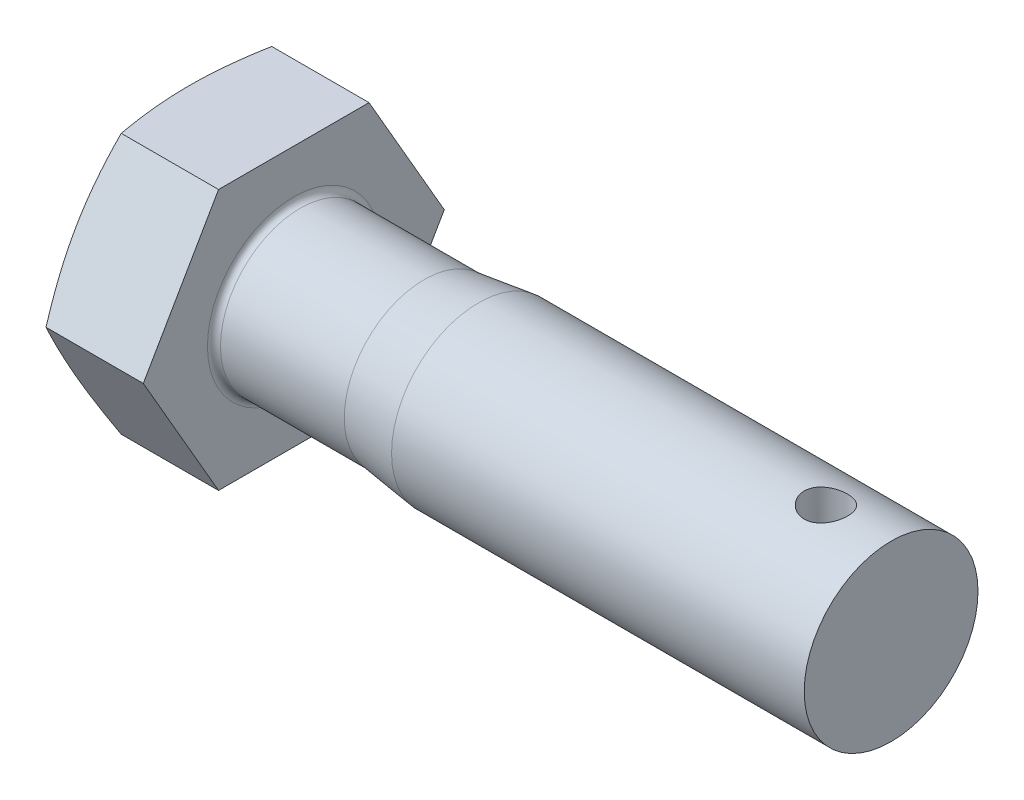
ISO-10303-21;
HEADER;
FILE_DESCRIPTION(('STEP AP214'),'2;1');
FILE_NAME('part.step','',(''),(''),'','','');
FILE_SCHEMA(('AUTOMOTIVE_DESIGN { 1 0 10303 214 1 1 1 1 }'));
ENDSEC;
DATA;
#1=APPLICATION_CONTEXT('core data for automotive mechanical design processes');
#2=APPLICATION_PROTOCOL_DEFINITION('international standard','automotive_design',2000,#1);
#3=PRODUCT_CONTEXT('',#1,'mechanical');
#4=PRODUCT('Part','Part','',(#3));
#5=PRODUCT_RELATED_PRODUCT_CATEGORY('part','',(#4));
#6=PRODUCT_DEFINITION_FORMATION('','',#4);
#7=PRODUCT_DEFINITION_CONTEXT('part definition',#1,'design');
#8=PRODUCT_DEFINITION('design','',#6,#7);
#9=PRODUCT_DEFINITION_SHAPE('','',#8);
#10=(LENGTH_UNIT() NAMED_UNIT(*) SI_UNIT(.MILLI.,.METRE.));
#11=(NAMED_UNIT(*) PLANE_ANGLE_UNIT() SI_UNIT($,.RADIAN.));
#12=(NAMED_UNIT(*) SI_UNIT($,.STERADIAN.) SOLID_ANGLE_UNIT());
#13=UNCERTAINTY_MEASURE_WITH_UNIT(LENGTH_MEASURE(1.E-05),#10,'distance_accuracy_value','');
#14=(GEOMETRIC_REPRESENTATION_CONTEXT(3) GLOBAL_UNCERTAINTY_ASSIGNED_CONTEXT((#13)) GLOBAL_UNIT_ASSIGNED_CONTEXT((#10,
#11,#12)) REPRESENTATION_CONTEXT('',''));
#15=CARTESIAN_POINT('',(0.,0.,0.));
#16=DIRECTION('',(0.,0.,1.));
#17=DIRECTION('',(1.,0.,0.));
#18=AXIS2_PLACEMENT_3D('',#15,#16,#17);
#19=CARTESIAN_POINT('',(0.,-12.,20.7846096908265));
#20=DIRECTION('',(-1.,0.,0.));
#21=DIRECTION('',(0.,0.,1.));
#22=AXIS2_PLACEMENT_3D('',#19,#20,#21);
#23=PLANE('',#22);
#24=CARTESIAN_POINT('',(0.,0.,0.));
#25=DIRECTION('',(-1.,0.,0.));
#26=DIRECTION('',(0.,0.,1.));
#27=AXIS2_PLACEMENT_3D('',#24,#25,#26);
#28=CIRCLE('',#27,11.);
#29=CARTESIAN_POINT('',(0.,0.,11.));
#30=VERTEX_POINT('',#29);
#31=EDGE_CURVE('E98',#30,#30,#28,.T.);
#32=ORIENTED_EDGE('',*,*,#31,.T.);
#33=EDGE_LOOP('',(#32));
#34=FACE_BOUND('',#33,.T.);
#35=CARTESIAN_POINT('',(0.,0.,0.));
#36=DIRECTION('',(1.,0.,0.));
#37=DIRECTION('',(0.,0.,-1.));
#38=AXIS2_PLACEMENT_3D('',#35,#36,#37);
#39=CIRCLE('',#38,8.85);
#40=CARTESIAN_POINT('',(0.,0.,-8.85));
#41=VERTEX_POINT('',#40);
#42=EDGE_CURVE('E231',#41,#41,#39,.T.);
#43=ORIENTED_EDGE('',*,*,#42,.T.);
#44=EDGE_LOOP('',(#43));
#45=FACE_BOUND('',#44,.T.);
#46=ADVANCED_FACE('F32',(#34,#45),#23,.T.);
#47=CARTESIAN_POINT('',(10.,-12.,6.9282032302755));
#48=DIRECTION('',(0.,1.,0.));
#49=DIRECTION('',(0.,0.,1.));
#50=AXIS2_PLACEMENT_3D('',#47,#48,#49);
#51=PLANE('',#50);
#52=CARTESIAN_POINT('',(3.96396734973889,-12.,-18.3087950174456));
#53=CARTESIAN_POINT('',(3.79884886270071,-12.,-17.7662249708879));
#54=CARTESIAN_POINT('',(3.63566479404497,-12.,-17.2230552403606));
#55=CARTESIAN_POINT('',(3.31423573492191,-12.,-16.1352111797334));
#56=CARTESIAN_POINT('',(3.15599113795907,-12.,-15.5905367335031));
#57=CARTESIAN_POINT('',(2.84524590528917,-12.,-14.4984381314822));
#58=CARTESIAN_POINT('',(2.69275663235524,-12.,-13.951010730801));
#59=CARTESIAN_POINT('',(2.39531632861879,-12.,-12.8541146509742));
#60=CARTESIAN_POINT('',(2.25036516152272,-12.,-12.304646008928));
#61=CARTESIAN_POINT('',(1.97161365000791,-12.,-11.2101580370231));
#62=CARTESIAN_POINT('',(1.83769693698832,-12.,-10.6651684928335));
#63=CARTESIAN_POINT('',(1.58131725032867,-12.,-9.57247358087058));
#64=CARTESIAN_POINT('',(1.45885446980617,-12.,-9.02476816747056));
#65=CARTESIAN_POINT('',(1.22824895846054,-12.,-7.92652528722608));
#66=CARTESIAN_POINT('',(1.12010122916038,-12.,-7.37598887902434));
#67=CARTESIAN_POINT('',(0.921428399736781,-12.,-6.2717216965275));
#68=CARTESIAN_POINT('',(0.830902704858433,-12.,-5.71799103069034));
#69=CARTESIAN_POINT('',(0.680125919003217,-12.,-4.66974970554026));
#70=CARTESIAN_POINT('',(0.617617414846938,-12.,-4.17556679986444));
#71=CARTESIAN_POINT('',(0.511920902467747,-12.,-3.18512193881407));
#72=CARTESIAN_POINT('',(0.468732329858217,-12.,-2.68886004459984));
#73=CARTESIAN_POINT('',(0.403756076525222,-12.,-1.6952644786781));
#74=CARTESIAN_POINT('',(0.38195338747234,-12.,-1.197931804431));
#75=CARTESIAN_POINT('',(0.36085175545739,-12.,-0.202784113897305));
#76=CARTESIAN_POINT('',(0.361552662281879,-12.,0.295030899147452));
#77=CARTESIAN_POINT('',(0.38548121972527,-12.,1.29266481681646));
#78=CARTESIAN_POINT('',(0.408824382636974,-12.,1.79248090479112));
#79=CARTESIAN_POINT('',(0.476964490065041,-12.,2.79063583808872));
#80=CARTESIAN_POINT('',(0.521761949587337,-12.,3.28897464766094));
#81=CARTESIAN_POINT('',(0.630722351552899,-12.,4.28393280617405));
#82=CARTESIAN_POINT('',(0.694901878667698,-12.,4.78055031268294));
#83=CARTESIAN_POINT('',(0.840033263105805,-12.,5.77130057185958));
#84=CARTESIAN_POINT('',(0.920985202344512,-12.,6.26543331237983));
#85=CARTESIAN_POINT('',(1.10220294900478,-12.,7.28006763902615));
#86=CARTESIAN_POINT('',(1.2033232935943,-12.,7.8004152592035));
#87=CARTESIAN_POINT('',(1.41857818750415,-12.,8.83842892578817));
#88=CARTESIAN_POINT('',(1.53271372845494,-12.,9.35609476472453));
#89=CARTESIAN_POINT('',(1.77159173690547,-12.,10.3891186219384));
#90=CARTESIAN_POINT('',(1.89633731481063,-12.,10.904475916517));
#91=CARTESIAN_POINT('',(2.15439952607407,-12.,11.9330162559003));
#92=CARTESIAN_POINT('',(2.28771595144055,-12.,12.4461993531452));
#93=CARTESIAN_POINT('',(2.5614883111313,-12.,13.4713608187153));
#94=CARTESIAN_POINT('',(2.70195324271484,-12.,13.9833367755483));
#95=CARTESIAN_POINT('',(2.98857841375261,-12.,15.0056897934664));
#96=CARTESIAN_POINT('',(3.13473867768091,-12.,15.5160668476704));
#97=CARTESIAN_POINT('',(3.43170649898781,-12.,16.5353680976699));
#98=CARTESIAN_POINT('',(3.58251324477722,-12.,17.0442925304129));
#99=CARTESIAN_POINT('',(3.88799531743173,-12.,18.0609803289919));
#100=CARTESIAN_POINT('',(4.04267066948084,-12.,18.568743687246));
#101=CARTESIAN_POINT('',(4.50795433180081,-12.,20.0790517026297));
#102=CARTESIAN_POINT('',(4.82321954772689,-12.,21.0801614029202));
#103=CARTESIAN_POINT('',(5.46263375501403,-12.,23.0795787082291));
#104=CARTESIAN_POINT('',(5.78678317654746,-12.,24.0778861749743));
#105=CARTESIAN_POINT('',(6.44034806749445,-12.,26.0685686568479));
#106=CARTESIAN_POINT('',(6.76973882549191,-12.,27.0609517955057));
#107=CARTESIAN_POINT('',(7.26745556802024,-12.,28.5482638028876));
#108=CARTESIAN_POINT('',(7.43395945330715,-12.,29.0438040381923));
#109=CARTESIAN_POINT('',(7.76803768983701,-12.,30.0345222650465));
#110=CARTESIAN_POINT('',(7.93561203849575,-12.,30.5297002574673));
#111=CARTESIAN_POINT('',(8.10365001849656,-12.,31.02472094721));
#112=B_SPLINE_CURVE_WITH_KNOTS('',3,(#52,#53,#54,#55,#56,#57,#58,#59,#60,#61,#62,#63,#64,#65,
#66,#67,#68,#69,#70,#71,#72,#73,#74,#75,#76,#77,#78,#79,#80,#81,#82,#83,#84,#85,#86,#87,#88,#89,
#90,#91,#92,#93,#94,#95,#96,#97,#98,#99,#100,#101,#102,#103,#104,#105,#106,#107,#108,#109,#110,
#111),.UNSPECIFIED.,.F.,.F.,(4,2,2,2,2,2,2,2,2,2,2,2,2,2,2,2,2,2,2,2,2,2,2,2,2,2,2,2,2,4),(0.,
1.70142841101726,3.40299202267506,5.10775586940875,6.81248888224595,8.49599601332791,
10.1795315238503,11.8624776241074,13.5453669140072,15.0393995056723,16.5333884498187,
18.0263281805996,19.5192579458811,21.019844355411,22.5204667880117,24.0223769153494,
25.524294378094,27.1143358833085,28.7044986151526,30.2951291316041,31.8857210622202,
33.4783669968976,35.0710197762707,36.6633959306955,38.2557824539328,41.4044472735,
44.5532648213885,47.6901088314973,49.258404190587,50.8266957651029),.UNSPECIFIED.);
#113=CARTESIAN_POINT('',(1.03964692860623,-12.,-6.92820323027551));
#114=VERTEX_POINT('',#113);
#115=CARTESIAN_POINT('',(1.03964692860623,-12.,6.9282032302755));
#116=VERTEX_POINT('',#115);
#117=EDGE_CURVE('E54',#114,#116,#112,.T.);
#118=ORIENTED_EDGE('',*,*,#117,.F.);
#119=DIRECTION('',(-1.,0.,0.));
#120=VECTOR('',#119,1.);
#121=CARTESIAN_POINT('',(10.,-12.,-6.92820323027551));
#122=LINE('',#121,#120);
#123=CARTESIAN_POINT('',(10.,-12.,-6.92820323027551));
#124=VERTEX_POINT('',#123);
#125=EDGE_CURVE('E123',#124,#114,#122,.T.);
#126=ORIENTED_EDGE('',*,*,#125,.F.);
#127=DIRECTION('',(0.,0.,-1.));
#128=VECTOR('',#127,1.);
#129=CARTESIAN_POINT('',(10.,-12.,6.9282032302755));
#130=LINE('',#129,#128);
#131=CARTESIAN_POINT('',(10.,-12.,6.9282032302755));
#132=VERTEX_POINT('',#131);
#133=EDGE_CURVE('E260',#132,#124,#130,.T.);
#134=ORIENTED_EDGE('',*,*,#133,.F.);
#135=DIRECTION('',(-1.,0.,0.));
#136=VECTOR('',#135,1.);
#137=CARTESIAN_POINT('',(10.,-12.,6.9282032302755));
#138=LINE('',#137,#136);
#139=EDGE_CURVE('E111',#132,#116,#138,.T.);
#140=ORIENTED_EDGE('',*,*,#139,.T.);
#141=EDGE_LOOP('',(#118,#126,#134,#140));
#142=FACE_BOUND('',#141,.T.);
#143=ADVANCED_FACE('F34',(#142),#51,.F.);
#144=CARTESIAN_POINT('',(10.,-12.,-6.92820323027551));
#145=DIRECTION('',(0.,0.5,0.866025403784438));
#146=DIRECTION('',(0.,-0.866025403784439,0.5));
#147=AXIS2_PLACEMENT_3D('',#144,#145,#146);
#148=PLANE('',#147);
#149=CARTESIAN_POINT('',(1.03968895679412,0.000200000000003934,-13.8565219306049));
#150=CARTESIAN_POINT('',(0.935221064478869,-0.496762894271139,-13.5696002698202));
#151=CARTESIAN_POINT('',(0.84018959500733,-0.995364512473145,-13.2817324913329));
#152=CARTESIAN_POINT('',(0.672996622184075,-1.99580957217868,-12.7041252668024));
#153=CARTESIAN_POINT('',(0.600853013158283,-2.49765523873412,-12.414384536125));
#154=CARTESIAN_POINT('',(0.484162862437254,-3.49901930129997,-11.8362467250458));
#155=CARTESIAN_POINT('',(0.439361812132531,-3.99851483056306,-11.5478628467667));
#156=CARTESIAN_POINT('',(0.379271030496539,-4.99867391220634,-10.9704207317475));
#157=CARTESIAN_POINT('',(0.363970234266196,-5.49933695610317,-10.6813627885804));
#158=CARTESIAN_POINT('',(0.363970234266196,-6.50066304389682,-10.1032469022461));
#159=CARTESIAN_POINT('',(0.379271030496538,-7.00132608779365,-9.814188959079));
#160=CARTESIAN_POINT('',(0.43936181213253,-8.00148516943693,-9.23674684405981));
#161=CARTESIAN_POINT('',(0.484162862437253,-8.50098069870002,-8.94836296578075));
#162=CARTESIAN_POINT('',(0.600853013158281,-9.50234476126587,-8.37022515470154));
#163=CARTESIAN_POINT('',(0.672996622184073,-10.0041904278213,-8.0804844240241));
#164=CARTESIAN_POINT('',(0.840189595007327,-11.0046354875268,-7.50287719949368));
#165=CARTESIAN_POINT('',(0.935221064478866,-11.5032371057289,-7.21500942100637));
#166=CARTESIAN_POINT('',(1.03968895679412,-12.0002,-6.92808776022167));
#167=B_SPLINE_CURVE_WITH_KNOTS('',3,(#149,#150,#151,#152,#153,#154,#155,#156,#157,#158,#159,
#160,#161,#162,#163,#164,#165,#166),.UNSPECIFIED.,.F.,.F.,(4,2,2,2,2,2,2,2,4),(0.,
1.75000540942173,3.50137566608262,5.23618486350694,6.97034324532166,8.70450162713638,
10.4393108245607,12.1906810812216,13.9406864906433),.UNSPECIFIED.);
#168=CARTESIAN_POINT('',(1.03964692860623,0.,-13.856406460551));
#169=VERTEX_POINT('',#168);
#170=EDGE_CURVE('E193',#169,#114,#167,.T.);
#171=ORIENTED_EDGE('',*,*,#170,.F.);
#172=DIRECTION('',(-1.,0.,0.));
#173=VECTOR('',#172,1.);
#174=CARTESIAN_POINT('',(10.,0.,-13.856406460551));
#175=LINE('',#174,#173);
#176=CARTESIAN_POINT('',(10.,0.,-13.856406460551));
#177=VERTEX_POINT('',#176);
#178=EDGE_CURVE('E120',#177,#169,#175,.T.);
#179=ORIENTED_EDGE('',*,*,#178,.F.);
#180=DIRECTION('',(0.,0.866025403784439,-0.5));
#181=VECTOR('',#180,1.);
#182=CARTESIAN_POINT('',(10.,-12.,-6.92820323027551));
#183=LINE('',#182,#181);
#184=EDGE_CURVE('E261',#124,#177,#183,.T.);
#185=ORIENTED_EDGE('',*,*,#184,.F.);
#186=ORIENTED_EDGE('',*,*,#125,.T.);
#187=EDGE_LOOP('',(#171,#179,#185,#186));
#188=FACE_BOUND('',#187,.T.);
#189=ADVANCED_FACE('F201',(#188),#148,.F.);
#190=CARTESIAN_POINT('',(10.,0.,-13.856406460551));
#191=DIRECTION('',(0.,-0.5,0.866025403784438));
#192=DIRECTION('',(0.,-0.866025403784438,-0.500000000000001));
#193=AXIS2_PLACEMENT_3D('',#190,#191,#192);
#194=PLANE('',#193);
#195=CARTESIAN_POINT('',(1.03968895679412,12.0002,-6.92808776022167));
#196=CARTESIAN_POINT('',(0.935221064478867,11.5032371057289,-7.21500942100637));
#197=CARTESIAN_POINT('',(0.840189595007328,11.0046354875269,-7.50287719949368));
#198=CARTESIAN_POINT('',(0.672996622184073,10.0041904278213,-8.0804844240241));
#199=CARTESIAN_POINT('',(0.600853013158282,9.50234476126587,-8.37022515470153));
#200=CARTESIAN_POINT('',(0.484162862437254,8.50098069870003,-8.94836296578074));
#201=CARTESIAN_POINT('',(0.43936181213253,8.00148516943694,-9.2367468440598));
#202=CARTESIAN_POINT('',(0.379271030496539,7.00132608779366,-9.814188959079));
#203=CARTESIAN_POINT('',(0.363970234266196,6.50066304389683,-10.1032469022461));
#204=CARTESIAN_POINT('',(0.363970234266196,5.49933695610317,-10.6813627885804));
#205=CARTESIAN_POINT('',(0.379271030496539,4.99867391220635,-10.9704207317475));
#206=CARTESIAN_POINT('',(0.439361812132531,3.99851483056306,-11.5478628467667));
#207=CARTESIAN_POINT('',(0.484162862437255,3.49901930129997,-11.8362467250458));
#208=CARTESIAN_POINT('',(0.600853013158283,2.49765523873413,-12.414384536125));
#209=CARTESIAN_POINT('',(0.672996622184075,1.99580957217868,-12.7041252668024));
#210=CARTESIAN_POINT('',(0.840189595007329,0.995364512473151,-13.2817324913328));
#211=CARTESIAN_POINT('',(0.935221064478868,0.496762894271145,-13.5696002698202));
#212=CARTESIAN_POINT('',(1.03968895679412,-0.000199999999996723,-13.8565219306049));
#213=B_SPLINE_CURVE_WITH_KNOTS('',3,(#195,#196,#197,#198,#199,#200,#201,#202,#203,#204,#205,
#206,#207,#208,#209,#210,#211,#212),.UNSPECIFIED.,.F.,.F.,(4,2,2,2,2,2,2,2,4),(0.,
1.75000540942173,3.50137566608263,5.23618486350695,6.97034324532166,8.70450162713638,
10.4393108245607,12.1906810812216,13.9406864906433),.UNSPECIFIED.);
#214=CARTESIAN_POINT('',(1.03964692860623,12.,-6.92820323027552));
#215=VERTEX_POINT('',#214);
#216=EDGE_CURVE('E187',#215,#169,#213,.T.);
#217=ORIENTED_EDGE('',*,*,#216,.F.);
#218=DIRECTION('',(-1.,0.,0.));
#219=VECTOR('',#218,1.);
#220=CARTESIAN_POINT('',(10.,12.,-6.92820323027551));
#221=LINE('',#220,#219);
#222=CARTESIAN_POINT('',(10.,12.,-6.92820323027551));
#223=VERTEX_POINT('',#222);
#224=EDGE_CURVE('E113',#223,#215,#221,.T.);
#225=ORIENTED_EDGE('',*,*,#224,.F.);
#226=DIRECTION('',(0.,0.866025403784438,0.5));
#227=VECTOR('',#226,1.);
#228=CARTESIAN_POINT('',(10.,0.,-13.856406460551));
#229=LINE('',#228,#227);
#230=EDGE_CURVE('E265',#177,#223,#229,.T.);
#231=ORIENTED_EDGE('',*,*,#230,.F.);
#232=ORIENTED_EDGE('',*,*,#178,.T.);
#233=EDGE_LOOP('',(#217,#225,#231,#232));
#234=FACE_BOUND('',#233,.T.);
#235=ADVANCED_FACE('F204',(#234),#194,.F.);
#236=CARTESIAN_POINT('',(10.,12.,-6.92820323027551));
#237=DIRECTION('',(0.,-1.,0.));
#238=DIRECTION('',(0.,0.,-1.));
#239=AXIS2_PLACEMENT_3D('',#236,#237,#238);
#240=PLANE('',#239);
#241=CARTESIAN_POINT('',(3.96396734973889,12.,-18.3087950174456));
#242=CARTESIAN_POINT('',(3.79884886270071,12.,-17.7662249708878));
#243=CARTESIAN_POINT('',(3.63566479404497,12.,-17.2230552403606));
#244=CARTESIAN_POINT('',(3.31423573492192,12.,-16.1352111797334));
#245=CARTESIAN_POINT('',(3.15599113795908,12.,-15.5905367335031));
#246=CARTESIAN_POINT('',(2.84524590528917,12.,-14.4984381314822));
#247=CARTESIAN_POINT('',(2.69275663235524,12.,-13.951010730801));
#248=CARTESIAN_POINT('',(2.39531632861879,12.,-12.8541146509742));
#249=CARTESIAN_POINT('',(2.25036516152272,12.,-12.304646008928));
#250=CARTESIAN_POINT('',(1.97161365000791,12.,-11.2101580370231));
#251=CARTESIAN_POINT('',(1.83769693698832,12.,-10.6651684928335));
#252=CARTESIAN_POINT('',(1.58131725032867,12.,-9.57247358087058));
#253=CARTESIAN_POINT('',(1.45885446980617,12.,-9.02476816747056));
#254=CARTESIAN_POINT('',(1.22824895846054,12.,-7.92652528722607));
#255=CARTESIAN_POINT('',(1.12010122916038,12.,-7.37598887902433));
#256=CARTESIAN_POINT('',(0.921428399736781,12.,-6.2717216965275));
#257=CARTESIAN_POINT('',(0.830902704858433,12.,-5.71799103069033));
#258=CARTESIAN_POINT('',(0.680125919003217,12.,-4.66974970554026));
#259=CARTESIAN_POINT('',(0.617617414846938,12.,-4.17556679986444));
#260=CARTESIAN_POINT('',(0.511920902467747,12.,-3.18512193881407));
#261=CARTESIAN_POINT('',(0.468732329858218,12.,-2.68886004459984));
#262=CARTESIAN_POINT('',(0.403756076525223,12.,-1.69526447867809));
#263=CARTESIAN_POINT('',(0.381953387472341,12.,-1.19793180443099));
#264=CARTESIAN_POINT('',(0.360851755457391,12.,-0.202784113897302));
#265=CARTESIAN_POINT('',(0.361552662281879,12.,0.295030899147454));
#266=CARTESIAN_POINT('',(0.385481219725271,12.,1.29266481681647));
#267=CARTESIAN_POINT('',(0.408824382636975,12.,1.79248090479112));
#268=CARTESIAN_POINT('',(0.476964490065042,12.,2.79063583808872));
#269=CARTESIAN_POINT('',(0.521761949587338,12.,3.28897464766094));
#270=CARTESIAN_POINT('',(0.630722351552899,12.,4.28393280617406));
#271=CARTESIAN_POINT('',(0.694901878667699,12.,4.78055031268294));
#272=CARTESIAN_POINT('',(0.840033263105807,12.,5.77130057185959));
#273=CARTESIAN_POINT('',(0.920985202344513,12.,6.26543331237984));
#274=CARTESIAN_POINT('',(1.10220294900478,12.,7.28006763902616));
#275=CARTESIAN_POINT('',(1.2033232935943,12.,7.80041525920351));
#276=CARTESIAN_POINT('',(1.41857818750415,12.,8.83842892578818));
#277=CARTESIAN_POINT('',(1.53271372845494,12.,9.35609476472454));
#278=CARTESIAN_POINT('',(1.77159173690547,12.,10.3891186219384));
#279=CARTESIAN_POINT('',(1.89633731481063,12.,10.904475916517));
#280=CARTESIAN_POINT('',(2.15439952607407,12.,11.9330162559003));
#281=CARTESIAN_POINT('',(2.28771595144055,12.,12.4461993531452));
#282=CARTESIAN_POINT('',(2.5614883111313,12.,13.4713608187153));
#283=CARTESIAN_POINT('',(2.70195324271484,12.,13.9833367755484));
#284=CARTESIAN_POINT('',(2.98857841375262,12.,15.0056897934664));
#285=CARTESIAN_POINT('',(3.13473867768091,12.,15.5160668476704));
#286=CARTESIAN_POINT('',(3.43170649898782,12.,16.5353680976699));
#287=CARTESIAN_POINT('',(3.58251324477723,12.,17.0442925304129));
#288=CARTESIAN_POINT('',(3.88799531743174,12.,18.0609803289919));
#289=CARTESIAN_POINT('',(4.04267066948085,12.,18.5687436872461));
#290=CARTESIAN_POINT('',(4.50795433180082,12.,20.0790517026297));
#291=CARTESIAN_POINT('',(4.8232195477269,12.,21.0801614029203));
#292=CARTESIAN_POINT('',(5.46263375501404,12.,23.0795787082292));
#293=CARTESIAN_POINT('',(5.78678317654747,12.,24.0778861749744));
#294=CARTESIAN_POINT('',(6.44034806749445,12.,26.0685686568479));
#295=CARTESIAN_POINT('',(6.76973882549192,12.,27.0609517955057));
#296=CARTESIAN_POINT('',(7.26745556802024,12.,28.5482638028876));
#297=CARTESIAN_POINT('',(7.43395945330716,12.,29.0438040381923));
#298=CARTESIAN_POINT('',(7.76803768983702,12.,30.0345222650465));
#299=CARTESIAN_POINT('',(7.93561203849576,12.,30.5297002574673));
#300=CARTESIAN_POINT('',(8.10365001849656,12.,31.02472094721));
#301=B_SPLINE_CURVE_WITH_KNOTS('',3,(#241,#242,#243,#244,#245,#246,#247,#248,#249,#250,#251,
#252,#253,#254,#255,#256,#257,#258,#259,#260,#261,#262,#263,#264,#265,#266,#267,#268,#269,#270,
#271,#272,#273,#274,#275,#276,#277,#278,#279,#280,#281,#282,#283,#284,#285,#286,#287,#288,#289,
#290,#291,#292,#293,#294,#295,#296,#297,#298,#299,#300),.UNSPECIFIED.,.F.,.F.,(4,2,2,2,2,2,2,2,
2,2,2,2,2,2,2,2,2,2,2,2,2,2,2,2,2,2,2,2,2,4),(0.,1.70142841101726,3.40299202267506,
5.10775586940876,6.81248888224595,8.49599601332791,10.1795315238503,11.8624776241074,
13.5453669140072,15.0393995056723,16.5333884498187,18.0263281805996,19.5192579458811,
21.019844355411,22.5204667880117,24.0223769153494,25.524294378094,27.1143358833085,
28.7044986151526,30.2951291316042,31.8857210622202,33.4783669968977,35.0710197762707,
36.6633959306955,38.2557824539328,41.4044472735,44.5532648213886,47.6901088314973,
49.258404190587,50.8266957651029),.UNSPECIFIED.);
#302=CARTESIAN_POINT('',(1.03964692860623,12.,6.92820323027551));
#303=VERTEX_POINT('',#302);
#304=EDGE_CURVE('E108',#303,#215,#301,.F.);
#305=ORIENTED_EDGE('',*,*,#304,.F.);
#306=DIRECTION('',(-1.,0.,0.));
#307=VECTOR('',#306,1.);
#308=CARTESIAN_POINT('',(10.,12.,6.92820323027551));
#309=LINE('',#308,#307);
#310=CARTESIAN_POINT('',(10.,12.,6.92820323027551));
#311=VERTEX_POINT('',#310);
#312=EDGE_CURVE('E107',#311,#303,#309,.T.);
#313=ORIENTED_EDGE('',*,*,#312,.F.);
#314=DIRECTION('',(0.,0.,1.));
#315=VECTOR('',#314,1.);
#316=CARTESIAN_POINT('',(10.,12.,-6.92820323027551));
#317=LINE('',#316,#315);
#318=EDGE_CURVE('E267',#223,#311,#317,.T.);
#319=ORIENTED_EDGE('',*,*,#318,.F.);
#320=ORIENTED_EDGE('',*,*,#224,.T.);
#321=EDGE_LOOP('',(#305,#313,#319,#320));
#322=FACE_BOUND('',#321,.T.);
#323=ADVANCED_FACE('F208',(#322),#240,.F.);
#324=CARTESIAN_POINT('',(10.,12.,6.92820323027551));
#325=DIRECTION('',(0.,-0.5,-0.866025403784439));
#326=DIRECTION('',(0.,0.866025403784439,-0.5));
#327=AXIS2_PLACEMENT_3D('',#324,#325,#326);
#328=PLANE('',#327);
#329=CARTESIAN_POINT('',(1.03968895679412,-0.000199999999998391,13.8565219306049));
#330=CARTESIAN_POINT('',(0.93522106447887,0.496762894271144,13.5696002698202));
#331=CARTESIAN_POINT('',(0.840189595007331,0.99536451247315,13.2817324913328));
#332=CARTESIAN_POINT('',(0.672996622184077,1.99580957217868,12.7041252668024));
#333=CARTESIAN_POINT('',(0.600853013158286,2.49765523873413,12.414384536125));
#334=CARTESIAN_POINT('',(0.484162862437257,3.49901930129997,11.8362467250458));
#335=CARTESIAN_POINT('',(0.439361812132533,3.99851483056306,11.5478628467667));
#336=CARTESIAN_POINT('',(0.379271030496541,4.99867391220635,10.9704207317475));
#337=CARTESIAN_POINT('',(0.363970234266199,5.49933695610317,10.6813627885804));
#338=CARTESIAN_POINT('',(0.363970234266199,6.50066304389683,10.1032469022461));
#339=CARTESIAN_POINT('',(0.379271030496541,7.00132608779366,9.814188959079));
#340=CARTESIAN_POINT('',(0.439361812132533,8.00148516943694,9.23674684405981));
#341=CARTESIAN_POINT('',(0.484162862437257,8.50098069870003,8.94836296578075));
#342=CARTESIAN_POINT('',(0.600853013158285,9.50234476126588,8.37022515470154));
#343=CARTESIAN_POINT('',(0.672996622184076,10.0041904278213,8.0804844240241));
#344=CARTESIAN_POINT('',(0.840189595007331,11.0046354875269,7.50287719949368));
#345=CARTESIAN_POINT('',(0.935221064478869,11.5032371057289,7.21500942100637));
#346=CARTESIAN_POINT('',(1.03968895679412,12.0002,6.92808776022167));
#347=B_SPLINE_CURVE_WITH_KNOTS('',3,(#329,#330,#331,#332,#333,#334,#335,#336,#337,#338,#339,
#340,#341,#342,#343,#344,#345,#346),.UNSPECIFIED.,.F.,.F.,(4,2,2,2,2,2,2,2,4),(0.,
1.75000540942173,3.50137566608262,5.23618486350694,6.97034324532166,8.70450162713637,
10.4393108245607,12.1906810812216,13.9406864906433),.UNSPECIFIED.);
#348=CARTESIAN_POINT('',(1.03964692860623,0.,13.856406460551));
#349=VERTEX_POINT('',#348);
#350=EDGE_CURVE('E93',#349,#303,#347,.T.);
#351=ORIENTED_EDGE('',*,*,#350,.F.);
#352=DIRECTION('',(-1.,0.,0.));
#353=VECTOR('',#352,1.);
#354=CARTESIAN_POINT('',(10.,0.,13.856406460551));
#355=LINE('',#354,#353);
#356=CARTESIAN_POINT('',(10.,0.,13.856406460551));
#357=VERTEX_POINT('',#356);
#358=EDGE_CURVE('E105',#357,#349,#355,.T.);
#359=ORIENTED_EDGE('',*,*,#358,.F.);
#360=DIRECTION('',(0.,-0.866025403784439,0.5));
#361=VECTOR('',#360,1.);
#362=CARTESIAN_POINT('',(10.,12.,6.92820323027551));
#363=LINE('',#362,#361);
#364=EDGE_CURVE('E269',#311,#357,#363,.T.);
#365=ORIENTED_EDGE('',*,*,#364,.F.);
#366=ORIENTED_EDGE('',*,*,#312,.T.);
#367=EDGE_LOOP('',(#351,#359,#365,#366));
#368=FACE_BOUND('',#367,.T.);
#369=ADVANCED_FACE('F103',(#368),#328,.F.);
#370=CARTESIAN_POINT('',(10.,0.,13.856406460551));
#371=DIRECTION('',(0.,0.5,-0.866025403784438));
#372=DIRECTION('',(0.,0.866025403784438,0.5));
#373=AXIS2_PLACEMENT_3D('',#370,#371,#372);
#374=PLANE('',#373);
#375=CARTESIAN_POINT('',(1.03968895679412,-12.0002,6.92808776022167));
#376=CARTESIAN_POINT('',(0.935221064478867,-11.5032371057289,7.21500942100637));
#377=CARTESIAN_POINT('',(0.840189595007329,-11.0046354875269,7.50287719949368));
#378=CARTESIAN_POINT('',(0.672996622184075,-10.0041904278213,8.0804844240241));
#379=CARTESIAN_POINT('',(0.600853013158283,-9.50234476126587,8.37022515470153));
#380=CARTESIAN_POINT('',(0.484162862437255,-8.50098069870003,8.94836296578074));
#381=CARTESIAN_POINT('',(0.439361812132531,-8.00148516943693,9.2367468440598));
#382=CARTESIAN_POINT('',(0.379271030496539,-7.00132608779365,9.814188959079));
#383=CARTESIAN_POINT('',(0.363970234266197,-6.50066304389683,10.1032469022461));
#384=CARTESIAN_POINT('',(0.363970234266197,-5.49933695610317,10.6813627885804));
#385=CARTESIAN_POINT('',(0.37927103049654,-4.99867391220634,10.9704207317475));
#386=CARTESIAN_POINT('',(0.439361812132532,-3.99851483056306,11.5478628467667));
#387=CARTESIAN_POINT('',(0.484162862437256,-3.49901930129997,11.8362467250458));
#388=CARTESIAN_POINT('',(0.600853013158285,-2.49765523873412,12.414384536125));
#389=CARTESIAN_POINT('',(0.672996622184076,-1.99580957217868,12.7041252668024));
#390=CARTESIAN_POINT('',(0.840189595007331,-0.995364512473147,13.2817324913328));
#391=CARTESIAN_POINT('',(0.93522106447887,-0.496762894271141,13.5696002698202));
#392=CARTESIAN_POINT('',(1.03968895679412,0.000200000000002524,13.8565219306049));
#393=B_SPLINE_CURVE_WITH_KNOTS('',3,(#375,#376,#377,#378,#379,#380,#381,#382,#383,#384,#385,
#386,#387,#388,#389,#390,#391,#392),.UNSPECIFIED.,.F.,.F.,(4,2,2,2,2,2,2,2,4),(0.,
1.75000540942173,3.50137566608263,5.23618486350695,6.97034324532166,8.70450162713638,
10.4393108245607,12.1906810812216,13.9406864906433),.UNSPECIFIED.);
#394=EDGE_CURVE('E90',#116,#349,#393,.T.);
#395=ORIENTED_EDGE('',*,*,#394,.F.);
#396=ORIENTED_EDGE('',*,*,#139,.F.);
#397=DIRECTION('',(0.,-0.866025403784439,-0.5));
#398=VECTOR('',#397,1.);
#399=CARTESIAN_POINT('',(10.,0.,13.856406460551));
#400=LINE('',#399,#398);
#401=EDGE_CURVE('E62',#357,#132,#400,.T.);
#402=ORIENTED_EDGE('',*,*,#401,.F.);
#403=ORIENTED_EDGE('',*,*,#358,.T.);
#404=EDGE_LOOP('',(#395,#396,#402,#403));
#405=FACE_BOUND('',#404,.T.);
#406=ADVANCED_FACE('F110',(#405),#374,.F.);
#407=CARTESIAN_POINT('',(10.,-12.,20.7846096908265));
#408=DIRECTION('',(-1.,0.,0.));
#409=DIRECTION('',(0.,0.,1.));
#410=AXIS2_PLACEMENT_3D('',#407,#408,#409);
#411=PLANE('',#410);
#412=CARTESIAN_POINT('',(10.,0.,0.));
#413=DIRECTION('',(-1.,0.,0.));
#414=DIRECTION('',(0.,0.,1.));
#415=AXIS2_PLACEMENT_3D('',#412,#413,#414);
#416=CIRCLE('',#415,7.9505);
#417=CARTESIAN_POINT('',(10.,0.,7.9505));
#418=VERTEX_POINT('',#417);
#419=EDGE_CURVE('E46',#418,#418,#416,.T.);
#420=ORIENTED_EDGE('',*,*,#419,.T.);
#421=EDGE_LOOP('',(#420));
#422=FACE_BOUND('',#421,.T.);
#423=ORIENTED_EDGE('',*,*,#133,.T.);
#424=ORIENTED_EDGE('',*,*,#184,.T.);
#425=ORIENTED_EDGE('',*,*,#230,.T.);
#426=ORIENTED_EDGE('',*,*,#318,.T.);
#427=ORIENTED_EDGE('',*,*,#364,.T.);
#428=ORIENTED_EDGE('',*,*,#401,.T.);
#429=EDGE_LOOP('',(#423,#424,#425,#426,#427,#428));
#430=FACE_BOUND('',#429,.T.);
#431=ADVANCED_FACE('F164',(#422,#430),#411,.F.);
#432=CARTESIAN_POINT('',(0.,0.,0.));
#433=DIRECTION('',(1.,0.,0.));
#434=DIRECTION('',(0.,0.,-1.));
#435=AXIS2_PLACEMENT_3D('',#432,#433,#434);
#436=CONICAL_SURFACE('',#435,11.,1.22173047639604);
#437=ORIENTED_EDGE('',*,*,#31,.F.);
#438=EDGE_LOOP('',(#437));
#439=FACE_BOUND('',#438,.T.);
#440=ORIENTED_EDGE('',*,*,#117,.T.);
#441=ORIENTED_EDGE('',*,*,#394,.T.);
#442=ORIENTED_EDGE('',*,*,#350,.T.);
#443=ORIENTED_EDGE('',*,*,#304,.T.);
#444=ORIENTED_EDGE('',*,*,#216,.T.);
#445=ORIENTED_EDGE('',*,*,#170,.T.);
#446=EDGE_LOOP('',(#440,#441,#442,#443,#444,#445));
#447=FACE_BOUND('',#446,.T.);
#448=ADVANCED_FACE('F92',(#439,#447),#436,.T.);
#449=CARTESIAN_POINT('',(2.,0.,0.));
#450=DIRECTION('',(-1.,0.,0.));
#451=DIRECTION('',(0.,0.,1.));
#452=AXIS2_PLACEMENT_3D('',#449,#450,#451);
#453=CYLINDRICAL_SURFACE('',#452,8.85);
#454=CARTESIAN_POINT('',(2.,0.,0.));
#455=DIRECTION('',(1.,0.,0.));
#456=DIRECTION('',(0.,0.,-1.));
#457=AXIS2_PLACEMENT_3D('',#454,#455,#456);
#458=CIRCLE('',#457,8.85);
#459=CARTESIAN_POINT('',(2.,0.,-8.85));
#460=VERTEX_POINT('',#459);
#461=EDGE_CURVE('E233',#460,#460,#458,.T.);
#462=ORIENTED_EDGE('',*,*,#461,.T.);
#463=EDGE_LOOP('',(#462));
#464=FACE_BOUND('',#463,.T.);
#465=ORIENTED_EDGE('',*,*,#42,.F.);
#466=EDGE_LOOP('',(#465));
#467=FACE_BOUND('',#466,.T.);
#468=ADVANCED_FACE('F157',(#464,#467),#453,.F.);
#469=CARTESIAN_POINT('',(2.,0.,0.));
#470=DIRECTION('',(1.,0.,0.));
#471=DIRECTION('',(0.,0.,-1.));
#472=AXIS2_PLACEMENT_3D('',#469,#470,#471);
#473=PLANE('',#472);
#474=ORIENTED_EDGE('',*,*,#461,.F.);
#475=EDGE_LOOP('',(#474));
#476=FACE_BOUND('',#475,.T.);
#477=ADVANCED_FACE('F153',(#476),#473,.F.);
#478=CARTESIAN_POINT('',(22.,0.,0.));
#479=DIRECTION('',(1.,0.,0.));
#480=DIRECTION('',(0.,0.,-1.));
#481=AXIS2_PLACEMENT_3D('',#478,#479,#480);
#482=CONICAL_SURFACE('',#481,7.3505,0.129176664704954);
#483=CARTESIAN_POINT('',(27.,0.,0.));
#484=DIRECTION('',(-1.,0.,0.));
#485=DIRECTION('',(0.,0.,1.));
#486=AXIS2_PLACEMENT_3D('',#483,#484,#485);
#487=CIRCLE('',#486,8.);
#488=CARTESIAN_POINT('',(27.,0.,7.99999999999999));
#489=VERTEX_POINT('',#488);
#490=EDGE_CURVE('E234',#489,#489,#487,.T.);
#491=ORIENTED_EDGE('',*,*,#490,.T.);
#492=EDGE_LOOP('',(#491));
#493=FACE_BOUND('',#492,.T.);
#494=CARTESIAN_POINT('',(22.,0.,0.));
#495=DIRECTION('',(-1.,0.,0.));
#496=DIRECTION('',(0.,0.,1.));
#497=AXIS2_PLACEMENT_3D('',#494,#495,#496);
#498=CIRCLE('',#497,7.3505);
#499=CARTESIAN_POINT('',(22.,0.,7.3505));
#500=VERTEX_POINT('',#499);
#501=EDGE_CURVE('E239',#500,#500,#498,.T.);
#502=ORIENTED_EDGE('',*,*,#501,.F.);
#503=EDGE_LOOP('',(#502));
#504=FACE_BOUND('',#503,.T.);
#505=ADVANCED_FACE('F149',(#493,#504),#482,.T.);
#506=CARTESIAN_POINT('',(0.,0.,0.));
#507=DIRECTION('',(-1.,0.,0.));
#508=DIRECTION('',(0.,0.,1.));
#509=AXIS2_PLACEMENT_3D('',#506,#507,#508);
#510=CYLINDRICAL_SURFACE('',#509,7.3505);
#511=CARTESIAN_POINT('',(10.6,0.,0.));
#512=DIRECTION('',(-1.,0.,0.));
#513=DIRECTION('',(0.,0.,1.));
#514=AXIS2_PLACEMENT_3D('',#511,#512,#513);
#515=CIRCLE('',#514,7.3505);
#516=CARTESIAN_POINT('',(10.6,0.,7.3505));
#517=VERTEX_POINT('',#516);
#518=EDGE_CURVE('E11',#517,#517,#515,.F.);
#519=ORIENTED_EDGE('',*,*,#518,.T.);
#520=EDGE_LOOP('',(#519));
#521=FACE_BOUND('',#520,.T.);
#522=ORIENTED_EDGE('',*,*,#501,.T.);
#523=EDGE_LOOP('',(#522));
#524=FACE_BOUND('',#523,.T.);
#525=ADVANCED_FACE('F145',(#521,#524),#510,.T.);
#526=CARTESIAN_POINT('',(65.,0.,0.));
#527=DIRECTION('',(1.,0.,0.));
#528=DIRECTION('',(0.,0.,-1.));
#529=AXIS2_PLACEMENT_3D('',#526,#527,#528);
#530=PLANE('',#529);
#531=CARTESIAN_POINT('',(65.,0.,0.));
#532=DIRECTION('',(1.,0.,0.));
#533=DIRECTION('',(0.,0.,-1.));
#534=AXIS2_PLACEMENT_3D('',#531,#532,#533);
#535=CIRCLE('',#534,8.);
#536=CARTESIAN_POINT('',(65.,0.,-8.));
#537=VERTEX_POINT('',#536);
#538=EDGE_CURVE('E256',#537,#537,#535,.T.);
#539=ORIENTED_EDGE('',*,*,#538,.T.);
#540=EDGE_LOOP('',(#539));
#541=FACE_BOUND('',#540,.T.);
#542=ADVANCED_FACE('F148',(#541),#530,.T.);
#543=CARTESIAN_POINT('',(65.,0.,0.));
#544=DIRECTION('',(-1.,0.,0.));
#545=DIRECTION('',(0.,0.,1.));
#546=AXIS2_PLACEMENT_3D('',#543,#544,#545);
#547=CYLINDRICAL_SURFACE('',#546,8.);
#548=CARTESIAN_POINT('',(59.,-7.74596669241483,2.));
#549=CARTESIAN_POINT('',(59.1104406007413,-7.74596880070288,1.99999686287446));
#550=CARTESIAN_POINT('',(59.2209159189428,-7.74835444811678,1.99082099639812));
#551=CARTESIAN_POINT('',(59.4386940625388,-7.75761489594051,1.95441850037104));
#552=CARTESIAN_POINT('',(59.5459950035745,-7.76449230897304,1.92718136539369));
#553=CARTESIAN_POINT('',(59.7542428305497,-7.7819097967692,1.85559295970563));
#554=CARTESIAN_POINT('',(59.8551977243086,-7.79244514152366,1.81126378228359));
#555=CARTESIAN_POINT('',(60.0482486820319,-7.81598553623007,1.70681691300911));
#556=CARTESIAN_POINT('',(60.1403443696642,-7.82899069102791,1.64669855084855));
#557=CARTESIAN_POINT('',(60.3150893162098,-7.856325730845,1.51096674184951));
#558=CARTESIAN_POINT('',(60.39751488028,-7.87067678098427,1.43506951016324));
#559=CARTESIAN_POINT('',(60.5486091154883,-7.89890300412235,1.27054565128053));
#560=CARTESIAN_POINT('',(60.6172765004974,-7.91277813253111,1.18191783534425));
#561=CARTESIAN_POINT('',(60.739820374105,-7.93872332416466,0.992916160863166));
#562=CARTESIAN_POINT('',(60.7934771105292,-7.95076549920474,0.892395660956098));
#563=CARTESIAN_POINT('',(60.8830477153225,-7.97144649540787,0.683410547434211));
#564=CARTESIAN_POINT('',(60.9189642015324,-7.98008581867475,0.574947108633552));
#565=CARTESIAN_POINT('',(60.9713182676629,-7.99283807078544,0.355487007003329));
#566=CARTESIAN_POINT('',(60.9881357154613,-7.99703915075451,0.24458617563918));
#567=CARTESIAN_POINT('',(61.0030067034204,-8.00074875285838,0.0214630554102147));
#568=CARTESIAN_POINT('',(61.0010630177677,-8.00025796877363,-0.0907590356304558));
#569=CARTESIAN_POINT('',(60.9787401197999,-7.99470475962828,-0.310704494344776));
#570=CARTESIAN_POINT('',(60.9587709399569,-7.98974401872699,-0.418472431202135));
#571=CARTESIAN_POINT('',(60.9016229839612,-7.97592669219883,-0.629076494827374));
#572=CARTESIAN_POINT('',(60.8644432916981,-7.96706989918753,-0.731912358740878));
#573=CARTESIAN_POINT('',(60.7735979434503,-7.94630007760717,-0.930813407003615));
#574=CARTESIAN_POINT('',(60.7197863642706,-7.93436015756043,-1.02680901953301));
#575=CARTESIAN_POINT('',(60.597315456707,-7.90871923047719,-1.20855124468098));
#576=CARTESIAN_POINT('',(60.5286535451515,-7.89501791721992,-1.29429607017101));
#577=CARTESIAN_POINT('',(60.3762330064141,-7.86690971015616,-1.45554807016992));
#578=CARTESIAN_POINT('',(60.2921160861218,-7.85249375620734,-1.5307153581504));
#579=CARTESIAN_POINT('',(60.1123200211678,-7.82492034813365,-1.66595275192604));
#580=CARTESIAN_POINT('',(60.0166403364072,-7.81176295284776,-1.72602215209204));
#581=CARTESIAN_POINT('',(59.8157679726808,-7.78816397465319,-1.8295762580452));
#582=CARTESIAN_POINT('',(59.7105314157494,-7.77773586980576,-1.87297913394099));
#583=CARTESIAN_POINT('',(59.4939316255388,-7.76094912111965,-1.94137124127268));
#584=CARTESIAN_POINT('',(59.3825697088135,-7.75458960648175,-1.96636441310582));
#585=CARTESIAN_POINT('',(59.1600323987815,-7.74684284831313,-1.99666371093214));
#586=CARTESIAN_POINT('',(59.0489297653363,-7.74532871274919,-2.00247237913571));
#587=CARTESIAN_POINT('',(58.8273424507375,-7.74709874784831,-1.99561359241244));
#588=CARTESIAN_POINT('',(58.716857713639,-7.75038247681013,-1.98294783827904));
#589=CARTESIAN_POINT('',(58.5015085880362,-7.76125665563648,-1.93994037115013));
#590=CARTESIAN_POINT('',(58.3965818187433,-7.768775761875,-1.9098912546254));
#591=CARTESIAN_POINT('',(58.1932548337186,-7.7872057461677,-1.8332944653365));
#592=CARTESIAN_POINT('',(58.0948553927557,-7.79811702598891,-1.78674483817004));
#593=CARTESIAN_POINT('',(57.9052469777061,-7.8223690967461,-1.67741653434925));
#594=CARTESIAN_POINT('',(57.8142169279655,-7.83575334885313,-1.61433740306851));
#595=CARTESIAN_POINT('',(57.6438493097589,-7.86333666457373,-1.47412058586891));
#596=CARTESIAN_POINT('',(57.5645136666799,-7.87753586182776,-1.39698058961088));
#597=CARTESIAN_POINT('',(57.4177511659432,-7.90557922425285,-1.22852544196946));
#598=CARTESIAN_POINT('',(57.3506719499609,-7.91940561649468,-1.13690390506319));
#599=CARTESIAN_POINT('',(57.232851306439,-7.94477773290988,-0.943405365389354));
#600=CARTESIAN_POINT('',(57.1821090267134,-7.95632357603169,-0.841528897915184));
#601=CARTESIAN_POINT('',(57.0988431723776,-7.9757609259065,-0.631116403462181));
#602=CARTESIAN_POINT('',(57.0661885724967,-7.98367864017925,-0.522634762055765));
#603=CARTESIAN_POINT('',(57.0196317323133,-7.99508234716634,-0.301499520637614));
#604=CARTESIAN_POINT('',(57.0057258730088,-7.99856919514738,-0.18884673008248));
#605=CARTESIAN_POINT('',(56.9972648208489,-8.00068338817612,0.0341670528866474));
#606=CARTESIAN_POINT('',(57.0021965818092,-7.99943957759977,0.144507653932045));
#607=CARTESIAN_POINT('',(57.0300956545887,-7.99251792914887,0.362734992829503));
#608=CARTESIAN_POINT('',(57.0530624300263,-7.98684022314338,0.470621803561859));
#609=CARTESIAN_POINT('',(57.1161044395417,-7.97170865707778,0.680342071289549));
#610=CARTESIAN_POINT('',(57.1560869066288,-7.96227529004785,0.782204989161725));
#611=CARTESIAN_POINT('',(57.2519411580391,-7.94062577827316,0.977834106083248));
#612=CARTESIAN_POINT('',(57.307814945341,-7.92840928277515,1.07159928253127));
#613=CARTESIAN_POINT('',(57.4354304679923,-7.90214499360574,1.25080385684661));
#614=CARTESIAN_POINT('',(57.5075202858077,-7.88806033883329,1.33598997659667));
#615=CARTESIAN_POINT('',(57.6648457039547,-7.85981298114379,1.49323004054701));
#616=CARTESIAN_POINT('',(57.7500846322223,-7.84565025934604,1.56528065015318));
#617=CARTESIAN_POINT('',(57.9332028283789,-7.81854951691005,1.69552405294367));
#618=CARTESIAN_POINT('',(58.0312882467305,-7.80563927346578,1.75343323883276));
#619=CARTESIAN_POINT('',(58.2361109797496,-7.78287910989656,1.85185379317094));
#620=CARTESIAN_POINT('',(58.3428419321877,-7.77302696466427,1.89237781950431));
#621=CARTESIAN_POINT('',(58.5411540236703,-7.75903817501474,1.94884505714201));
#622=CARTESIAN_POINT('',(58.6317863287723,-7.75417326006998,1.96798634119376));
#623=CARTESIAN_POINT('',(58.8149377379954,-7.7476367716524,1.99356458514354));
#624=CARTESIAN_POINT('',(58.9074566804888,-7.74596492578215,2.0000026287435));
#625=CARTESIAN_POINT('',(59.,-7.74596669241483,2.));
#626=B_SPLINE_CURVE_WITH_KNOTS('',3,(#548,#549,#550,#551,#552,#553,#554,#555,#556,#557,#558,
#559,#560,#561,#562,#563,#564,#565,#566,#567,#568,#569,#570,#571,#572,#573,#574,#575,#576,#577,
#578,#579,#580,#581,#582,#583,#584,#585,#586,#587,#588,#589,#590,#591,#592,#593,#594,#595,#596,
#597,#598,#599,#600,#601,#602,#603,#604,#605,#606,#607,#608,#609,#610,#611,#612,#613,#614,#615,
#616,#617,#618,#619,#620,#621,#622,#623,#624,#625),.UNSPECIFIED.,.T.,.F.,(4,2,2,2,2,2,2,2,2,2,2,
2,2,2,2,2,2,2,2,2,2,2,2,2,2,2,2,2,2,2,2,2,2,2,2,2,2,2,4),(0.,0.33098195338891,0.662156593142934,
0.992904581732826,1.32366661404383,1.66099163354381,1.99834817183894,2.34041197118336,
2.68242527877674,3.01751000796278,3.35254518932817,3.68014610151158,4.0077644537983,
4.33834299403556,4.66897908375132,5.0085637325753,5.34816424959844,5.68941145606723,
6.03058560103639,6.36274859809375,6.69488101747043,7.02157924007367,7.34831617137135,
7.68146276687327,8.01466415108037,8.35620264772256,8.69772332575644,9.03673658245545,
9.37568439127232,9.70546756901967,10.0352409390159,10.3632390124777,10.6912784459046,
11.0271767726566,11.3631602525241,11.7054118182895,12.0474137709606,12.3247826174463,
12.6021278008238),.UNSPECIFIED.);
#627=CARTESIAN_POINT('',(59.,-7.74596669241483,2.));
#628=VERTEX_POINT('',#627);
#629=EDGE_CURVE('E37',#628,#628,#626,.T.);
#630=ORIENTED_EDGE('',*,*,#629,.T.);
#631=EDGE_LOOP('',(#630));
#632=FACE_BOUND('',#631,.T.);
#633=CARTESIAN_POINT('',(59.,7.74596669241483,2.));
#634=CARTESIAN_POINT('',(58.8895593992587,7.74596880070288,1.99999686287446));
#635=CARTESIAN_POINT('',(58.7790840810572,7.74835444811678,1.99082099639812));
#636=CARTESIAN_POINT('',(58.5613059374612,7.75761489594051,1.95441850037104));
#637=CARTESIAN_POINT('',(58.4540049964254,7.76449230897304,1.92718136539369));
#638=CARTESIAN_POINT('',(58.2457571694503,7.7819097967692,1.85559295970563));
#639=CARTESIAN_POINT('',(58.1448022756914,7.79244514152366,1.8112637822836));
#640=CARTESIAN_POINT('',(57.9517513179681,7.81598553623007,1.70681691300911));
#641=CARTESIAN_POINT('',(57.8596556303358,7.82899069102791,1.64669855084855));
#642=CARTESIAN_POINT('',(57.6849106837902,7.856325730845,1.51096674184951));
#643=CARTESIAN_POINT('',(57.60248511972,7.87067678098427,1.43506951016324));
#644=CARTESIAN_POINT('',(57.4513908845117,7.89890300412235,1.27054565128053));
#645=CARTESIAN_POINT('',(57.3827234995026,7.91277813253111,1.18191783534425));
#646=CARTESIAN_POINT('',(57.260179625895,7.93872332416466,0.992916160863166));
#647=CARTESIAN_POINT('',(57.2065228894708,7.95076549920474,0.892395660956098));
#648=CARTESIAN_POINT('',(57.1169522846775,7.97144649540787,0.683410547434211));
#649=CARTESIAN_POINT('',(57.0810357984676,7.98008581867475,0.574947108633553));
#650=CARTESIAN_POINT('',(57.0286817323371,7.99283807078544,0.355487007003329));
#651=CARTESIAN_POINT('',(57.0118642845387,7.99703915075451,0.24458617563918));
#652=CARTESIAN_POINT('',(56.9969932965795,8.00074875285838,0.0214630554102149));
#653=CARTESIAN_POINT('',(56.9989369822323,8.00025796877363,-0.0907590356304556));
#654=CARTESIAN_POINT('',(57.0212598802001,7.99470475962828,-0.310704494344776));
#655=CARTESIAN_POINT('',(57.0412290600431,7.98974401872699,-0.418472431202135));
#656=CARTESIAN_POINT('',(57.0983770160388,7.97592669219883,-0.629076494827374));
#657=CARTESIAN_POINT('',(57.1355567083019,7.96706989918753,-0.731912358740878));
#658=CARTESIAN_POINT('',(57.2264020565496,7.94630007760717,-0.930813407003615));
#659=CARTESIAN_POINT('',(57.2802136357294,7.93436015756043,-1.02680901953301));
#660=CARTESIAN_POINT('',(57.402684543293,7.90871923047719,-1.20855124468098));
#661=CARTESIAN_POINT('',(57.4713464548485,7.89501791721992,-1.29429607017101));
#662=CARTESIAN_POINT('',(57.6237669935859,7.86690971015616,-1.45554807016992));
#663=CARTESIAN_POINT('',(57.7078839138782,7.85249375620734,-1.5307153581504));
#664=CARTESIAN_POINT('',(57.8876799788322,7.82492034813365,-1.66595275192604));
#665=CARTESIAN_POINT('',(57.9833596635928,7.81176295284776,-1.72602215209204));
#666=CARTESIAN_POINT('',(58.1842320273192,7.78816397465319,-1.8295762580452));
#667=CARTESIAN_POINT('',(58.2894685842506,7.77773586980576,-1.87297913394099));
#668=CARTESIAN_POINT('',(58.5060683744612,7.76094912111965,-1.94137124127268));
#669=CARTESIAN_POINT('',(58.6174302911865,7.75458960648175,-1.96636441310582));
#670=CARTESIAN_POINT('',(58.8399676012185,7.74684284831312,-1.99666371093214));
#671=CARTESIAN_POINT('',(58.9510702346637,7.74532871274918,-2.00247237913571));
#672=CARTESIAN_POINT('',(59.1726575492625,7.74709874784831,-1.99561359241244));
#673=CARTESIAN_POINT('',(59.283142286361,7.75038247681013,-1.98294783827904));
#674=CARTESIAN_POINT('',(59.4984914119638,7.76125665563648,-1.93994037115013));
#675=CARTESIAN_POINT('',(59.6034181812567,7.768775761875,-1.9098912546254));
#676=CARTESIAN_POINT('',(59.8067451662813,7.7872057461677,-1.8332944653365));
#677=CARTESIAN_POINT('',(59.9051446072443,7.79811702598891,-1.78674483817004));
#678=CARTESIAN_POINT('',(60.0947530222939,7.8223690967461,-1.67741653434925));
#679=CARTESIAN_POINT('',(60.1857830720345,7.83575334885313,-1.61433740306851));
#680=CARTESIAN_POINT('',(60.3561506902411,7.86333666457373,-1.47412058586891));
#681=CARTESIAN_POINT('',(60.4354863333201,7.87753586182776,-1.39698058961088));
#682=CARTESIAN_POINT('',(60.5822488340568,7.90557922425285,-1.22852544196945));
#683=CARTESIAN_POINT('',(60.649328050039,7.91940561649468,-1.13690390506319));
#684=CARTESIAN_POINT('',(60.767148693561,7.94477773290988,-0.943405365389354));
#685=CARTESIAN_POINT('',(60.8178909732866,7.95632357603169,-0.841528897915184));
#686=CARTESIAN_POINT('',(60.9011568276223,7.9757609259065,-0.631116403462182));
#687=CARTESIAN_POINT('',(60.9338114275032,7.98367864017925,-0.522634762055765));
#688=CARTESIAN_POINT('',(60.9803682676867,7.99508234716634,-0.301499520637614));
#689=CARTESIAN_POINT('',(60.9942741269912,7.99856919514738,-0.188846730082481));
#690=CARTESIAN_POINT('',(61.0027351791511,8.00068338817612,0.0341670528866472));
#691=CARTESIAN_POINT('',(60.9978034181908,7.99943957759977,0.144507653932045));
#692=CARTESIAN_POINT('',(60.9699043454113,7.99251792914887,0.362734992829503));
#693=CARTESIAN_POINT('',(60.9469375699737,7.98684022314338,0.470621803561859));
#694=CARTESIAN_POINT('',(60.8838955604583,7.97170865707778,0.68034207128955));
#695=CARTESIAN_POINT('',(60.8439130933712,7.96227529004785,0.782204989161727));
#696=CARTESIAN_POINT('',(60.7480588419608,7.94062577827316,0.97783410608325));
#697=CARTESIAN_POINT('',(60.692185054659,7.92840928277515,1.07159928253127));
#698=CARTESIAN_POINT('',(60.5645695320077,7.90214499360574,1.25080385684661));
#699=CARTESIAN_POINT('',(60.4924797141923,7.88806033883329,1.33598997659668));
#700=CARTESIAN_POINT('',(60.3351542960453,7.85981298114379,1.49323004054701));
#701=CARTESIAN_POINT('',(60.2499153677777,7.84565025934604,1.56528065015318));
#702=CARTESIAN_POINT('',(60.0667971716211,7.81854951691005,1.69552405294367));
#703=CARTESIAN_POINT('',(59.9687117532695,7.80563927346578,1.75343323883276));
#704=CARTESIAN_POINT('',(59.7638890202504,7.78287910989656,1.85185379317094));
#705=CARTESIAN_POINT('',(59.6571580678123,7.77302696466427,1.89237781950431));
#706=CARTESIAN_POINT('',(59.4588459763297,7.75903817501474,1.94884505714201));
#707=CARTESIAN_POINT('',(59.3682136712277,7.75417326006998,1.96798634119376));
#708=CARTESIAN_POINT('',(59.1850622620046,7.7476367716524,1.99356458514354));
#709=CARTESIAN_POINT('',(59.0925433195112,7.74596492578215,2.0000026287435));
#710=CARTESIAN_POINT('',(59.,7.74596669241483,2.));
#711=B_SPLINE_CURVE_WITH_KNOTS('',3,(#633,#634,#635,#636,#637,#638,#639,#640,#641,#642,#643,
#644,#645,#646,#647,#648,#649,#650,#651,#652,#653,#654,#655,#656,#657,#658,#659,#660,#661,#662,
#663,#664,#665,#666,#667,#668,#669,#670,#671,#672,#673,#674,#675,#676,#677,#678,#679,#680,#681,
#682,#683,#684,#685,#686,#687,#688,#689,#690,#691,#692,#693,#694,#695,#696,#697,#698,#699,#700,
#701,#702,#703,#704,#705,#706,#707,#708,#709,#710),.UNSPECIFIED.,.T.,.F.,(4,2,2,2,2,2,2,2,2,2,2,
2,2,2,2,2,2,2,2,2,2,2,2,2,2,2,2,2,2,2,2,2,2,2,2,2,2,2,4),(0.,0.330981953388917,
0.662156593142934,0.992904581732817,1.32366661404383,1.66099163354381,1.99834817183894,
2.34041197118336,2.68242527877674,3.01751000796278,3.35254518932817,3.68014610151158,
4.0077644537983,4.33834299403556,4.66897908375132,5.0085637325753,5.34816424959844,
5.68941145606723,6.03058560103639,6.36274859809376,6.69488101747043,7.02157924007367,
7.34831617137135,7.68146276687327,8.01466415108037,8.35620264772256,8.69772332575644,
9.03673658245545,9.37568439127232,9.70546756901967,10.0352409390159,10.3632390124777,
10.6912784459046,11.0271767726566,11.3631602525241,11.7054118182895,12.0474137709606,
12.3247826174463,12.6021278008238),.UNSPECIFIED.);
#712=CARTESIAN_POINT('',(59.,7.74596669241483,2.));
#713=VERTEX_POINT('',#712);
#714=EDGE_CURVE('E127',#713,#713,#711,.T.);
#715=ORIENTED_EDGE('',*,*,#714,.T.);
#716=EDGE_LOOP('',(#715));
#717=FACE_BOUND('',#716,.T.);
#718=ORIENTED_EDGE('',*,*,#538,.F.);
#719=EDGE_LOOP('',(#718));
#720=FACE_BOUND('',#719,.T.);
#721=ORIENTED_EDGE('',*,*,#490,.F.);
#722=EDGE_LOOP('',(#721));
#723=FACE_BOUND('',#722,.T.);
#724=ADVANCED_FACE('F131',(#632,#717,#720,#723),#547,.T.);
#725=CARTESIAN_POINT('',(10.6,0.,0.));
#726=DIRECTION('',(-1.,0.,0.));
#727=DIRECTION('',(0.,0.,1.));
#728=AXIS2_PLACEMENT_3D('',#725,#726,#727);
#729=TOROIDAL_SURFACE('',#728,7.9505,0.6);
#730=ORIENTED_EDGE('',*,*,#518,.F.);
#731=EDGE_LOOP('',(#730));
#732=FACE_BOUND('',#731,.T.);
#733=ORIENTED_EDGE('',*,*,#419,.F.);
#734=EDGE_LOOP('',(#733));
#735=FACE_BOUND('',#734,.T.);
#736=ADVANCED_FACE('F139',(#732,#735),#729,.F.);
#737=CARTESIAN_POINT('',(59.,-12.,0.));
#738=DIRECTION('',(0.,1.,0.));
#739=DIRECTION('',(0.,0.,1.));
#740=AXIS2_PLACEMENT_3D('',#737,#738,#739);
#741=CYLINDRICAL_SURFACE('',#740,2.);
#742=ORIENTED_EDGE('',*,*,#714,.F.);
#743=EDGE_LOOP('',(#742));
#744=FACE_BOUND('',#743,.T.);
#745=ORIENTED_EDGE('',*,*,#629,.F.);
#746=EDGE_LOOP('',(#745));
#747=FACE_BOUND('',#746,.T.);
#748=ADVANCED_FACE('F135',(#744,#747),#741,.F.);
#749=CLOSED_SHELL('',(#46,#143,#189,#235,#323,#369,#406,#431,#448,#468,#477,#505,#525,#542,#724,
#736,#748));
#750=MANIFOLD_SOLID_BREP('B2',#749);
#751=ADVANCED_BREP_SHAPE_REPRESENTATION('',(#18,#750),#14);
#752=SHAPE_DEFINITION_REPRESENTATION(#9,#751);
ENDSEC;
END-ISO-10303-21;
